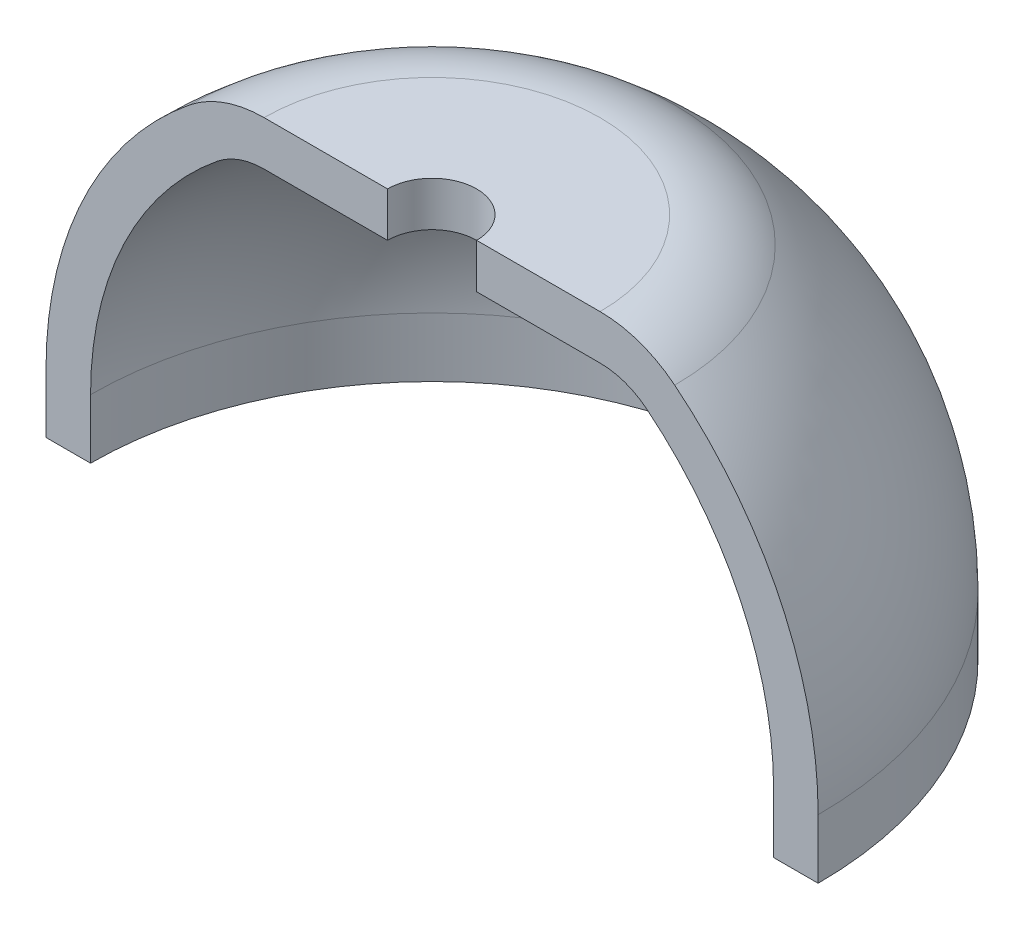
from build123d import *

# Parameters (mm, degrees)
ENL_V_MAT_EXTRU_1_REACH = 24.517
ESQUISSE2_R             = 1.5
ESQUISSE3_W             = 34.70190735
ESQUISSE3_H             = 15.039978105
COUPE_DEPTH             = 23.516660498


with BuildPart() as part:
    # Esquisse1 → R_volution1 (revolve)
    with BuildSketch(Plane.XY):
        with BuildLine():
            Line((13, 0), (13, -2))
            Line((13, -2), (11.5, -2))
            Line((11.5, -2), (11.5, 0))
            ThreePointArc((11.5, 0), (10.377242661, 4.956090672), (7.228202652, 8.944444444))
            ThreePointArc((7.228202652, 8.944444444), (6.490187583, 9.357022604), (5.656854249, 9.5))
            Line((5.656854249, 9.5), (0, 9.5))
            Line((0, 9.5), (0, 11))
            Line((0, 11), (5.656854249, 11))
            ThreePointArc((5.656854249, 11), (6.990187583, 10.771236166), (8.171011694, 10.111111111))
            ThreePointArc((8.171011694, 10.111111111), (11.730796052, 5.602537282), (13, 0))
        make_face()
    revolve(axis=Axis((0, 9.5, 0), (0, -1, 0)))

    # Esquisse2 → Enl_v. mat.-Extru.1 (cut, up to next)
    with BuildSketch(Plane(origin=(0, 11, 0), x_dir=(-1, 0, 0), z_dir=(0, 1, 0)), mode=Mode.PRIVATE) as enl_v_mat_extru_1_sk1:
        Circle(ESQUISSE2_R)
    enl_v_mat_extru_1_tool1 = extrude(enl_v_mat_extru_1_sk1.sketch, amount=-ENL_V_MAT_EXTRU_1_REACH, mode=Mode.PRIVATE) & part.part
    add(enl_v_mat_extru_1_tool1.solids().sort_by_distance((0, 11, 0))[0], mode=Mode.SUBTRACT)

    # Esquisse3 → Coupe (cut, through all)
    with BuildSketch(Plane(origin=(0, 11, 0), x_dir=(-1, 0, 0), z_dir=(0, 1, 0))):
        with Locations((0.484559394, 7.519989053)):
            Rectangle(ESQUISSE3_W, ESQUISSE3_H)
    extrude(amount=-COUPE_DEPTH, mode=Mode.SUBTRACT)


solid = part.part
